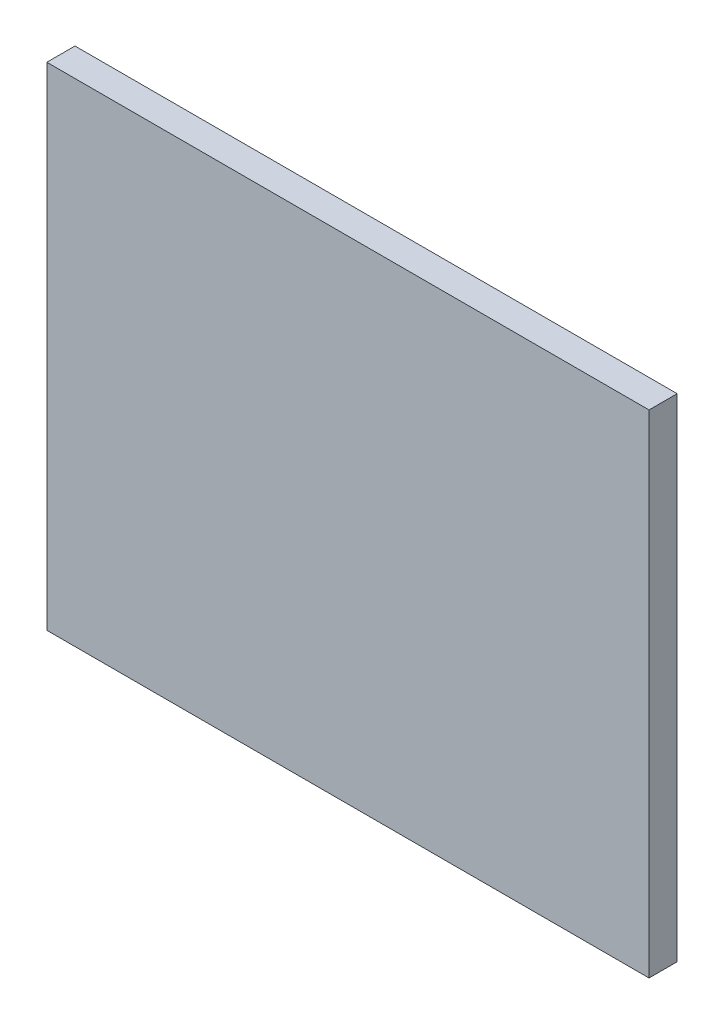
ISO-10303-21;
HEADER;
FILE_DESCRIPTION(('STEP AP214'),'2;1');
FILE_NAME('part.step','',(''),(''),'','','');
FILE_SCHEMA(('AUTOMOTIVE_DESIGN { 1 0 10303 214 1 1 1 1 }'));
ENDSEC;
DATA;
#1=APPLICATION_CONTEXT('core data for automotive mechanical design processes');
#2=APPLICATION_PROTOCOL_DEFINITION('international standard','automotive_design',2000,#1);
#3=PRODUCT_CONTEXT('',#1,'mechanical');
#4=PRODUCT('Part','Part','',(#3));
#5=PRODUCT_RELATED_PRODUCT_CATEGORY('part','',(#4));
#6=PRODUCT_DEFINITION_FORMATION('','',#4);
#7=PRODUCT_DEFINITION_CONTEXT('part definition',#1,'design');
#8=PRODUCT_DEFINITION('design','',#6,#7);
#9=PRODUCT_DEFINITION_SHAPE('','',#8);
#10=(LENGTH_UNIT() NAMED_UNIT(*) SI_UNIT(.MILLI.,.METRE.));
#11=(NAMED_UNIT(*) PLANE_ANGLE_UNIT() SI_UNIT($,.RADIAN.));
#12=(NAMED_UNIT(*) SI_UNIT($,.STERADIAN.) SOLID_ANGLE_UNIT());
#13=UNCERTAINTY_MEASURE_WITH_UNIT(LENGTH_MEASURE(1.E-05),#10,'distance_accuracy_value','');
#14=(GEOMETRIC_REPRESENTATION_CONTEXT(3) GLOBAL_UNCERTAINTY_ASSIGNED_CONTEXT((#13)) GLOBAL_UNIT_ASSIGNED_CONTEXT((#10,
#11,#12)) REPRESENTATION_CONTEXT('',''));
#15=CARTESIAN_POINT('',(0.,0.,0.));
#16=DIRECTION('',(0.,0.,1.));
#17=DIRECTION('',(1.,0.,0.));
#18=AXIS2_PLACEMENT_3D('',#15,#16,#17);
#19=CARTESIAN_POINT('',(-51.6053658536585,38.2300975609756,5.));
#20=DIRECTION('',(1.,0.,0.));
#21=DIRECTION('',(0.,0.,-1.));
#22=AXIS2_PLACEMENT_3D('',#19,#20,#21);
#23=PLANE('',#22);
#24=DIRECTION('',(0.,-1.,0.));
#25=VECTOR('',#24,1.);
#26=CARTESIAN_POINT('',(-51.6053658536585,38.2300975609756,0.));
#27=LINE('',#26,#25);
#28=CARTESIAN_POINT('',(-51.6053658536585,38.2300975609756,0.));
#29=VERTEX_POINT('',#28);
#30=CARTESIAN_POINT('',(-51.6053658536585,-49.1830731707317,0.));
#31=VERTEX_POINT('',#30);
#32=EDGE_CURVE('E70',#29,#31,#27,.T.);
#33=ORIENTED_EDGE('',*,*,#32,.T.);
#34=DIRECTION('',(0.,0.,-1.));
#35=VECTOR('',#34,1.);
#36=CARTESIAN_POINT('',(-51.6053658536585,-49.1830731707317,5.));
#37=LINE('',#36,#35);
#38=CARTESIAN_POINT('',(-51.6053658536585,-49.1830731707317,5.));
#39=VERTEX_POINT('',#38);
#40=EDGE_CURVE('E11',#39,#31,#37,.T.);
#41=ORIENTED_EDGE('',*,*,#40,.F.);
#42=DIRECTION('',(0.,-1.,0.));
#43=VECTOR('',#42,1.);
#44=CARTESIAN_POINT('',(-51.6053658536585,38.2300975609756,5.));
#45=LINE('',#44,#43);
#46=CARTESIAN_POINT('',(-51.6053658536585,38.2300975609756,5.));
#47=VERTEX_POINT('',#46);
#48=EDGE_CURVE('E88',#47,#39,#45,.T.);
#49=ORIENTED_EDGE('',*,*,#48,.F.);
#50=DIRECTION('',(0.,0.,-1.));
#51=VECTOR('',#50,1.);
#52=CARTESIAN_POINT('',(-51.6053658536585,38.2300975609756,5.));
#53=LINE('',#52,#51);
#54=EDGE_CURVE('E82',#47,#29,#53,.T.);
#55=ORIENTED_EDGE('',*,*,#54,.T.);
#56=EDGE_LOOP('',(#33,#41,#49,#55));
#57=FACE_BOUND('',#56,.T.);
#58=ADVANCED_FACE('F26',(#57),#23,.F.);
#59=CARTESIAN_POINT('',(-51.6053658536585,-49.1830731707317,5.));
#60=DIRECTION('',(0.,1.,0.));
#61=DIRECTION('',(0.,0.,1.));
#62=AXIS2_PLACEMENT_3D('',#59,#60,#61);
#63=PLANE('',#62);
#64=DIRECTION('',(1.,0.,0.));
#65=VECTOR('',#64,1.);
#66=CARTESIAN_POINT('',(-51.6053658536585,-49.1830731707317,0.));
#67=LINE('',#66,#65);
#68=CARTESIAN_POINT('',(55.3967804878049,-49.1830731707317,0.));
#69=VERTEX_POINT('',#68);
#70=EDGE_CURVE('E66',#31,#69,#67,.T.);
#71=ORIENTED_EDGE('',*,*,#70,.T.);
#72=DIRECTION('',(0.,0.,-1.));
#73=VECTOR('',#72,1.);
#74=CARTESIAN_POINT('',(55.3967804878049,-49.1830731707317,5.));
#75=LINE('',#74,#73);
#76=CARTESIAN_POINT('',(55.3967804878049,-49.1830731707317,5.));
#77=VERTEX_POINT('',#76);
#78=EDGE_CURVE('E33',#77,#69,#75,.T.);
#79=ORIENTED_EDGE('',*,*,#78,.F.);
#80=DIRECTION('',(1.,0.,0.));
#81=VECTOR('',#80,1.);
#82=CARTESIAN_POINT('',(-51.6053658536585,-49.1830731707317,5.));
#83=LINE('',#82,#81);
#84=EDGE_CURVE('E78',#39,#77,#83,.T.);
#85=ORIENTED_EDGE('',*,*,#84,.F.);
#86=ORIENTED_EDGE('',*,*,#40,.T.);
#87=EDGE_LOOP('',(#71,#79,#85,#86));
#88=FACE_BOUND('',#87,.T.);
#89=ADVANCED_FACE('F77',(#88),#63,.F.);
#90=CARTESIAN_POINT('',(55.3967804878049,38.2300975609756,5.));
#91=DIRECTION('',(-1.,0.,0.));
#92=DIRECTION('',(0.,0.,1.));
#93=AXIS2_PLACEMENT_3D('',#90,#91,#92);
#94=PLANE('',#93);
#95=DIRECTION('',(0.,1.,0.));
#96=VECTOR('',#95,1.);
#97=CARTESIAN_POINT('',(55.3967804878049,38.2300975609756,0.));
#98=LINE('',#97,#96);
#99=CARTESIAN_POINT('',(55.3967804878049,38.2300975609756,0.));
#100=VERTEX_POINT('',#99);
#101=EDGE_CURVE('E71',#69,#100,#98,.T.);
#102=ORIENTED_EDGE('',*,*,#101,.T.);
#103=DIRECTION('',(0.,0.,-1.));
#104=VECTOR('',#103,1.);
#105=CARTESIAN_POINT('',(55.3967804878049,38.2300975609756,5.));
#106=LINE('',#105,#104);
#107=CARTESIAN_POINT('',(55.3967804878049,38.2300975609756,5.));
#108=VERTEX_POINT('',#107);
#109=EDGE_CURVE('E94',#108,#100,#106,.T.);
#110=ORIENTED_EDGE('',*,*,#109,.F.);
#111=DIRECTION('',(0.,1.,0.));
#112=VECTOR('',#111,1.);
#113=CARTESIAN_POINT('',(55.3967804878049,38.2300975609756,5.));
#114=LINE('',#113,#112);
#115=EDGE_CURVE('E45',#77,#108,#114,.T.);
#116=ORIENTED_EDGE('',*,*,#115,.F.);
#117=ORIENTED_EDGE('',*,*,#78,.T.);
#118=EDGE_LOOP('',(#102,#110,#116,#117));
#119=FACE_BOUND('',#118,.T.);
#120=ADVANCED_FACE('F97',(#119),#94,.F.);
#121=CARTESIAN_POINT('',(-51.6053658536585,38.2300975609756,5.));
#122=DIRECTION('',(0.,-1.,0.));
#123=DIRECTION('',(0.,0.,-1.));
#124=AXIS2_PLACEMENT_3D('',#121,#122,#123);
#125=PLANE('',#124);
#126=DIRECTION('',(-1.,0.,0.));
#127=VECTOR('',#126,1.);
#128=CARTESIAN_POINT('',(-51.6053658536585,38.2300975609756,0.));
#129=LINE('',#128,#127);
#130=EDGE_CURVE('E86',#100,#29,#129,.T.);
#131=ORIENTED_EDGE('',*,*,#130,.T.);
#132=ORIENTED_EDGE('',*,*,#54,.F.);
#133=DIRECTION('',(-1.,0.,0.));
#134=VECTOR('',#133,1.);
#135=CARTESIAN_POINT('',(-51.6053658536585,38.2300975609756,5.));
#136=LINE('',#135,#134);
#137=EDGE_CURVE('E40',#108,#47,#136,.T.);
#138=ORIENTED_EDGE('',*,*,#137,.F.);
#139=ORIENTED_EDGE('',*,*,#109,.T.);
#140=EDGE_LOOP('',(#131,#132,#138,#139));
#141=FACE_BOUND('',#140,.T.);
#142=ADVANCED_FACE('F99',(#141),#125,.F.);
#143=CARTESIAN_POINT('',(-51.6053658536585,-49.1830731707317,5.));
#144=DIRECTION('',(0.,0.,1.));
#145=DIRECTION('',(1.,0.,0.));
#146=AXIS2_PLACEMENT_3D('',#143,#144,#145);
#147=PLANE('',#146);
#148=ORIENTED_EDGE('',*,*,#48,.T.);
#149=ORIENTED_EDGE('',*,*,#84,.T.);
#150=ORIENTED_EDGE('',*,*,#115,.T.);
#151=ORIENTED_EDGE('',*,*,#137,.T.);
#152=EDGE_LOOP('',(#148,#149,#150,#151));
#153=FACE_BOUND('',#152,.T.);
#154=ADVANCED_FACE('F100',(#153),#147,.T.);
#155=CARTESIAN_POINT('',(-51.6053658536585,-49.1830731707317,0.));
#156=DIRECTION('',(0.,0.,1.));
#157=DIRECTION('',(1.,0.,0.));
#158=AXIS2_PLACEMENT_3D('',#155,#156,#157);
#159=PLANE('',#158);
#160=ORIENTED_EDGE('',*,*,#32,.F.);
#161=ORIENTED_EDGE('',*,*,#130,.F.);
#162=ORIENTED_EDGE('',*,*,#101,.F.);
#163=ORIENTED_EDGE('',*,*,#70,.F.);
#164=EDGE_LOOP('',(#160,#161,#162,#163));
#165=FACE_BOUND('',#164,.T.);
#166=ADVANCED_FACE('F67',(#165),#159,.F.);
#167=CLOSED_SHELL('',(#58,#89,#120,#142,#154,#166));
#168=MANIFOLD_SOLID_BREP('B2',#167);
#169=ADVANCED_BREP_SHAPE_REPRESENTATION('',(#18,#168),#14);
#170=SHAPE_DEFINITION_REPRESENTATION(#9,#169);
ENDSEC;
END-ISO-10303-21;
